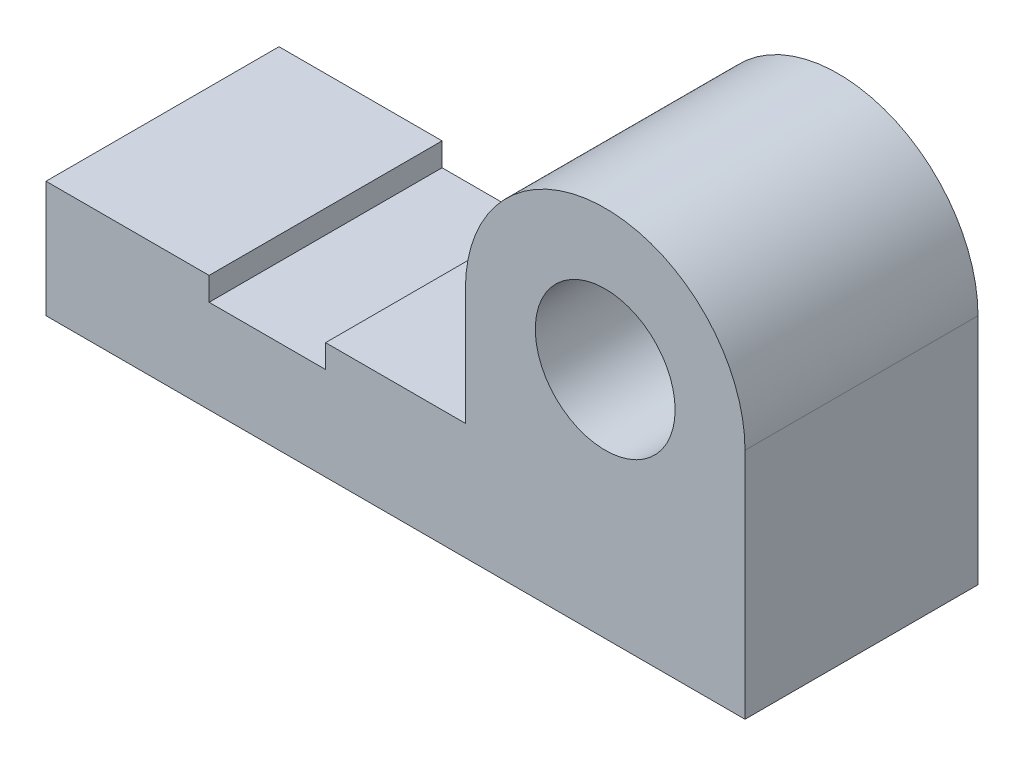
from build123d import *

# Parameters (mm, degrees)
SKETCH1_R           = 15
BOSS_EXTRUDE1_DEPTH = 50


with BuildPart() as part:
    # Sketch1 → Boss-Extrude1 (new body)
    with BuildSketch(Plane.XY):
        with BuildLine():
            Line((0, 0), (150, 0))
            Line((150, 0), (150, 50))
            ThreePointArc((150, 50), (120, 80), (90, 50))
            Line((90, 50), (90, 25))
            Line((90, 25), (60, 25))
            Line((60, 25), (60, 20))
            Line((60, 20), (35, 20))
            Line((35, 20), (35, 25))
            Line((35, 25), (0, 25))
            Line((0, 25), (0, 0))
        make_face()
        with Locations((120, 50)):
            Circle(SKETCH1_R, mode=Mode.SUBTRACT)
    extrude(amount=BOSS_EXTRUDE1_DEPTH)


solid = part.part
